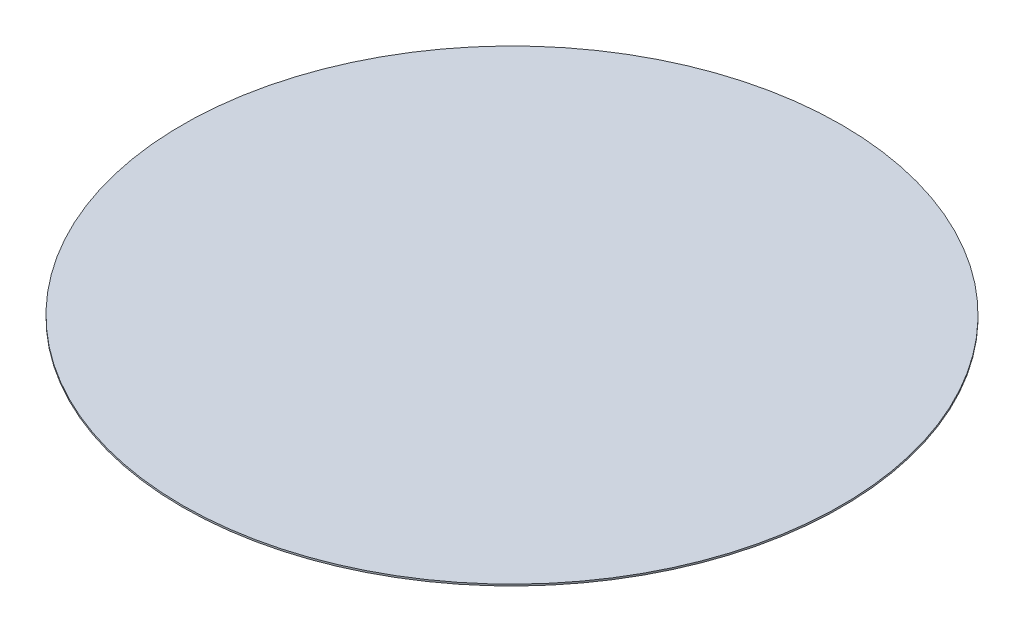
ISO-10303-21;
HEADER;
FILE_DESCRIPTION(('STEP AP214'),'2;1');
FILE_NAME('part.step','',(''),(''),'','','');
FILE_SCHEMA(('AUTOMOTIVE_DESIGN { 1 0 10303 214 1 1 1 1 }'));
ENDSEC;
DATA;
#1=APPLICATION_CONTEXT('core data for automotive mechanical design processes');
#2=APPLICATION_PROTOCOL_DEFINITION('international standard','automotive_design',2000,#1);
#3=PRODUCT_CONTEXT('',#1,'mechanical');
#4=PRODUCT('Part','Part','',(#3));
#5=PRODUCT_RELATED_PRODUCT_CATEGORY('part','',(#4));
#6=PRODUCT_DEFINITION_FORMATION('','',#4);
#7=PRODUCT_DEFINITION_CONTEXT('part definition',#1,'design');
#8=PRODUCT_DEFINITION('design','',#6,#7);
#9=PRODUCT_DEFINITION_SHAPE('','',#8);
#10=(LENGTH_UNIT() NAMED_UNIT(*) SI_UNIT(.MILLI.,.METRE.));
#11=(NAMED_UNIT(*) PLANE_ANGLE_UNIT() SI_UNIT($,.RADIAN.));
#12=(NAMED_UNIT(*) SI_UNIT($,.STERADIAN.) SOLID_ANGLE_UNIT());
#13=UNCERTAINTY_MEASURE_WITH_UNIT(LENGTH_MEASURE(1.E-05),#10,'distance_accuracy_value','');
#14=(GEOMETRIC_REPRESENTATION_CONTEXT(3) GLOBAL_UNCERTAINTY_ASSIGNED_CONTEXT((#13)) GLOBAL_UNIT_ASSIGNED_CONTEXT((#10,
#11,#12)) REPRESENTATION_CONTEXT('',''));
#15=CARTESIAN_POINT('',(0.,0.,0.));
#16=DIRECTION('',(0.,0.,1.));
#17=DIRECTION('',(1.,0.,0.));
#18=AXIS2_PLACEMENT_3D('',#15,#16,#17);
#19=CARTESIAN_POINT('',(0.,0.35,0.));
#20=DIRECTION('',(0.,-1.,0.));
#21=DIRECTION('',(0.,0.,-1.));
#22=AXIS2_PLACEMENT_3D('',#19,#20,#21);
#23=CYLINDRICAL_SURFACE('',#22,70.);
#24=CARTESIAN_POINT('',(0.,0.35,0.));
#25=DIRECTION('',(0.,1.,0.));
#26=DIRECTION('',(0.,0.,1.));
#27=AXIS2_PLACEMENT_3D('',#24,#25,#26);
#28=CIRCLE('',#27,70.);
#29=CARTESIAN_POINT('',(0.,0.35,70.));
#30=VERTEX_POINT('',#29);
#31=EDGE_CURVE('E10',#30,#30,#28,.T.);
#32=ORIENTED_EDGE('',*,*,#31,.F.);
#33=EDGE_LOOP('',(#32));
#34=FACE_BOUND('',#33,.T.);
#35=CARTESIAN_POINT('',(0.,0.,0.));
#36=DIRECTION('',(0.,1.,0.));
#37=DIRECTION('',(0.,0.,1.));
#38=AXIS2_PLACEMENT_3D('',#35,#36,#37);
#39=CIRCLE('',#38,70.);
#40=CARTESIAN_POINT('',(0.,0.,70.));
#41=VERTEX_POINT('',#40);
#42=EDGE_CURVE('E40',#41,#41,#39,.T.);
#43=ORIENTED_EDGE('',*,*,#42,.T.);
#44=EDGE_LOOP('',(#43));
#45=FACE_BOUND('',#44,.T.);
#46=ADVANCED_FACE('F37',(#34,#45),#23,.T.);
#47=CARTESIAN_POINT('',(0.,0.35,0.));
#48=DIRECTION('',(0.,1.,0.));
#49=DIRECTION('',(0.,0.,1.));
#50=AXIS2_PLACEMENT_3D('',#47,#48,#49);
#51=PLANE('',#50);
#52=ORIENTED_EDGE('',*,*,#31,.T.);
#53=EDGE_LOOP('',(#52));
#54=FACE_BOUND('',#53,.T.);
#55=ADVANCED_FACE('F52',(#54),#51,.T.);
#56=CARTESIAN_POINT('',(0.,0.,0.));
#57=DIRECTION('',(0.,1.,0.));
#58=DIRECTION('',(0.,0.,1.));
#59=AXIS2_PLACEMENT_3D('',#56,#57,#58);
#60=PLANE('',#59);
#61=ORIENTED_EDGE('',*,*,#42,.F.);
#62=EDGE_LOOP('',(#61));
#63=FACE_BOUND('',#62,.T.);
#64=ADVANCED_FACE('F50',(#63),#60,.F.);
#65=CLOSED_SHELL('',(#46,#55,#64));
#66=MANIFOLD_SOLID_BREP('B2',#65);
#67=ADVANCED_BREP_SHAPE_REPRESENTATION('',(#18,#66),#14);
#68=SHAPE_DEFINITION_REPRESENTATION(#9,#67);
ENDSEC;
END-ISO-10303-21;
